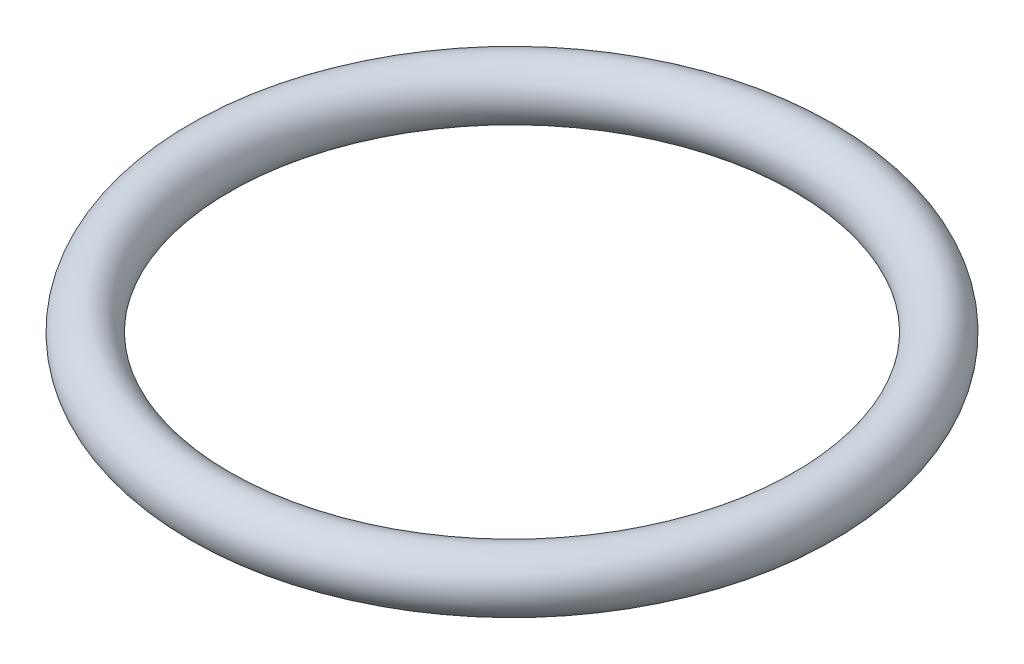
ISO-10303-21;
HEADER;
FILE_DESCRIPTION(('STEP AP214'),'2;1');
FILE_NAME('part.step','',(''),(''),'','','');
FILE_SCHEMA(('AUTOMOTIVE_DESIGN { 1 0 10303 214 1 1 1 1 }'));
ENDSEC;
DATA;
#1=APPLICATION_CONTEXT('core data for automotive mechanical design processes');
#2=APPLICATION_PROTOCOL_DEFINITION('international standard','automotive_design',2000,#1);
#3=PRODUCT_CONTEXT('',#1,'mechanical');
#4=PRODUCT('Part','Part','',(#3));
#5=PRODUCT_RELATED_PRODUCT_CATEGORY('part','',(#4));
#6=PRODUCT_DEFINITION_FORMATION('','',#4);
#7=PRODUCT_DEFINITION_CONTEXT('part definition',#1,'design');
#8=PRODUCT_DEFINITION('design','',#6,#7);
#9=PRODUCT_DEFINITION_SHAPE('','',#8);
#10=(LENGTH_UNIT() NAMED_UNIT(*) SI_UNIT(.MILLI.,.METRE.));
#11=(NAMED_UNIT(*) PLANE_ANGLE_UNIT() SI_UNIT($,.RADIAN.));
#12=(NAMED_UNIT(*) SI_UNIT($,.STERADIAN.) SOLID_ANGLE_UNIT());
#13=UNCERTAINTY_MEASURE_WITH_UNIT(LENGTH_MEASURE(1.E-05),#10,'distance_accuracy_value','');
#14=(GEOMETRIC_REPRESENTATION_CONTEXT(3) GLOBAL_UNCERTAINTY_ASSIGNED_CONTEXT((#13)) GLOBAL_UNIT_ASSIGNED_CONTEXT((#10,
#11,#12)) REPRESENTATION_CONTEXT('',''));
#15=CARTESIAN_POINT('',(0.,0.,0.));
#16=DIRECTION('',(0.,0.,1.));
#17=DIRECTION('',(1.,0.,0.));
#18=AXIS2_PLACEMENT_3D('',#15,#16,#17);
#19=CARTESIAN_POINT('',(0.,0.,0.));
#20=DIRECTION('',(0.,-1.,0.));
#21=DIRECTION('',(0.,0.,-1.));
#22=AXIS2_PLACEMENT_3D('',#19,#20,#21);
#23=TOROIDAL_SURFACE('',#22,8.7,0.800000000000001);
#24=ADVANCED_FACE('F14',(),#23,.T.);
#25=CLOSED_SHELL('',(#24));
#26=MANIFOLD_SOLID_BREP('B1',#25);
#27=ADVANCED_BREP_SHAPE_REPRESENTATION('',(#18,#26),#14);
#28=SHAPE_DEFINITION_REPRESENTATION(#9,#27);
ENDSEC;
END-ISO-10303-21;
